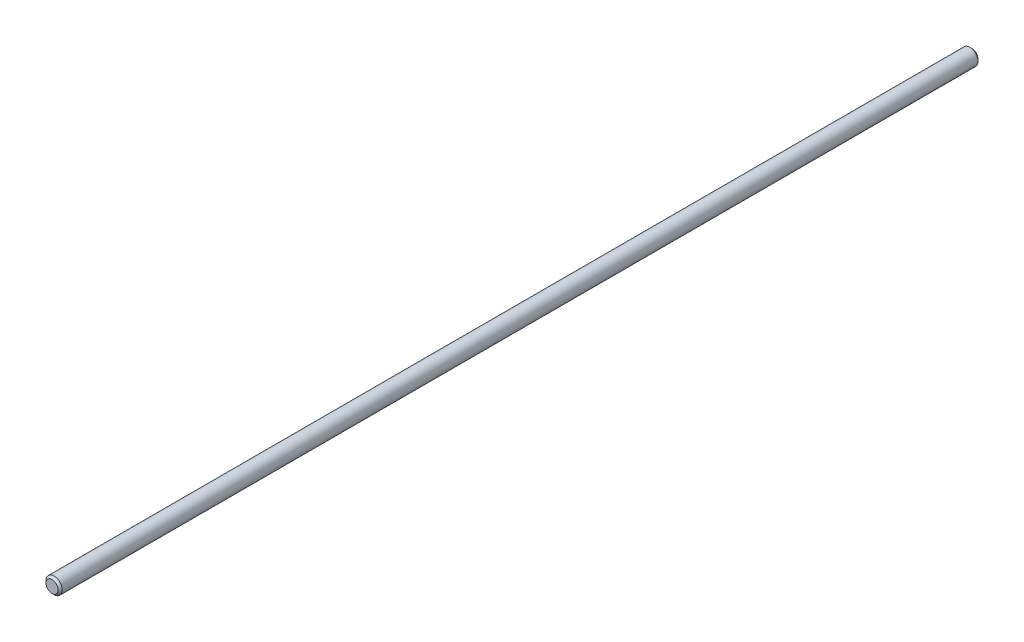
ISO-10303-21;
HEADER;
FILE_DESCRIPTION(('STEP AP214'),'2;1');
FILE_NAME('part.step','',(''),(''),'','','');
FILE_SCHEMA(('AUTOMOTIVE_DESIGN { 1 0 10303 214 1 1 1 1 }'));
ENDSEC;
DATA;
#1=APPLICATION_CONTEXT('core data for automotive mechanical design processes');
#2=APPLICATION_PROTOCOL_DEFINITION('international standard','automotive_design',2000,#1);
#3=PRODUCT_CONTEXT('',#1,'mechanical');
#4=PRODUCT('Part','Part','',(#3));
#5=PRODUCT_RELATED_PRODUCT_CATEGORY('part','',(#4));
#6=PRODUCT_DEFINITION_FORMATION('','',#4);
#7=PRODUCT_DEFINITION_CONTEXT('part definition',#1,'design');
#8=PRODUCT_DEFINITION('design','',#6,#7);
#9=PRODUCT_DEFINITION_SHAPE('','',#8);
#10=(LENGTH_UNIT() NAMED_UNIT(*) SI_UNIT(.MILLI.,.METRE.));
#11=(NAMED_UNIT(*) PLANE_ANGLE_UNIT() SI_UNIT($,.RADIAN.));
#12=(NAMED_UNIT(*) SI_UNIT($,.STERADIAN.) SOLID_ANGLE_UNIT());
#13=UNCERTAINTY_MEASURE_WITH_UNIT(LENGTH_MEASURE(1.E-05),#10,'distance_accuracy_value','');
#14=(GEOMETRIC_REPRESENTATION_CONTEXT(3) GLOBAL_UNCERTAINTY_ASSIGNED_CONTEXT((#13)) GLOBAL_UNIT_ASSIGNED_CONTEXT((#10,
#11,#12)) REPRESENTATION_CONTEXT('',''));
#15=CARTESIAN_POINT('',(0.,0.,0.));
#16=DIRECTION('',(0.,0.,1.));
#17=DIRECTION('',(1.,0.,0.));
#18=AXIS2_PLACEMENT_3D('',#15,#16,#17);
#19=CARTESIAN_POINT('',(0.,0.,-455.));
#20=DIRECTION('',(0.,0.,1.));
#21=DIRECTION('',(1.,0.,0.));
#22=AXIS2_PLACEMENT_3D('',#19,#20,#21);
#23=CYLINDRICAL_SURFACE('',#22,4.);
#24=CARTESIAN_POINT('',(0.,0.,-454.));
#25=DIRECTION('',(0.,0.,1.));
#26=DIRECTION('',(1.,0.,0.));
#27=AXIS2_PLACEMENT_3D('',#24,#25,#26);
#28=CIRCLE('',#27,4.);
#29=CARTESIAN_POINT('',(4.,0.,-454.));
#30=VERTEX_POINT('',#29);
#31=EDGE_CURVE('E352',#30,#30,#28,.T.);
#32=CARTESIAN_POINT('',(0.,0.,-1.00000000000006));
#33=DIRECTION('',(0.,0.,1.));
#34=DIRECTION('',(1.,0.,0.));
#35=AXIS2_PLACEMENT_3D('',#32,#33,#34);
#36=CIRCLE('',#35,4.);
#37=CARTESIAN_POINT('',(4.,0.,-1.00000000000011));
#38=VERTEX_POINT('',#37);
#39=EDGE_CURVE('E356',#38,#38,#36,.F.);
#40=CARTESIAN_POINT('',(4.,0.,-454.));
#41=CARTESIAN_POINT('',(4.,0.,-449.28125));
#42=CARTESIAN_POINT('',(4.,0.,-444.5625));
#43=CARTESIAN_POINT('',(4.,0.,-435.125));
#44=CARTESIAN_POINT('',(4.,0.,-430.40625));
#45=CARTESIAN_POINT('',(4.,0.,-420.96875));
#46=CARTESIAN_POINT('',(4.,0.,-416.25));
#47=CARTESIAN_POINT('',(4.,0.,-406.8125));
#48=CARTESIAN_POINT('',(4.,0.,-402.09375));
#49=CARTESIAN_POINT('',(4.,0.,-392.65625));
#50=CARTESIAN_POINT('',(4.,0.,-387.9375));
#51=CARTESIAN_POINT('',(4.,0.,-378.5));
#52=CARTESIAN_POINT('',(4.,0.,-373.78125));
#53=CARTESIAN_POINT('',(4.,0.,-364.34375));
#54=CARTESIAN_POINT('',(4.,0.,-359.625));
#55=CARTESIAN_POINT('',(4.,0.,-350.1875));
#56=CARTESIAN_POINT('',(4.,0.,-345.46875));
#57=CARTESIAN_POINT('',(4.,0.,-336.03125));
#58=CARTESIAN_POINT('',(4.,0.,-331.3125));
#59=CARTESIAN_POINT('',(4.,0.,-321.875));
#60=CARTESIAN_POINT('',(4.,0.,-317.15625));
#61=CARTESIAN_POINT('',(4.,0.,-307.71875));
#62=CARTESIAN_POINT('',(4.,0.,-303.));
#63=CARTESIAN_POINT('',(4.,0.,-293.5625));
#64=CARTESIAN_POINT('',(4.,0.,-288.84375));
#65=CARTESIAN_POINT('',(4.,0.,-279.40625));
#66=CARTESIAN_POINT('',(4.,0.,-274.6875));
#67=CARTESIAN_POINT('',(4.,0.,-265.25));
#68=CARTESIAN_POINT('',(4.,0.,-260.53125));
#69=CARTESIAN_POINT('',(4.,0.,-251.09375));
#70=CARTESIAN_POINT('',(4.,0.,-246.375));
#71=CARTESIAN_POINT('',(4.,0.,-236.9375));
#72=CARTESIAN_POINT('',(4.,0.,-232.21875));
#73=CARTESIAN_POINT('',(4.,0.,-222.78125));
#74=CARTESIAN_POINT('',(4.,0.,-218.0625));
#75=CARTESIAN_POINT('',(4.,0.,-208.625));
#76=CARTESIAN_POINT('',(4.,0.,-203.90625));
#77=CARTESIAN_POINT('',(4.,0.,-194.46875));
#78=CARTESIAN_POINT('',(4.,0.,-189.75));
#79=CARTESIAN_POINT('',(4.,0.,-180.3125));
#80=CARTESIAN_POINT('',(4.,0.,-175.59375));
#81=CARTESIAN_POINT('',(4.,0.,-166.15625));
#82=CARTESIAN_POINT('',(4.,0.,-161.4375));
#83=CARTESIAN_POINT('',(4.,0.,-152.));
#84=CARTESIAN_POINT('',(4.,0.,-147.28125));
#85=CARTESIAN_POINT('',(4.,0.,-137.84375));
#86=CARTESIAN_POINT('',(4.,0.,-133.125));
#87=CARTESIAN_POINT('',(4.,0.,-123.6875));
#88=CARTESIAN_POINT('',(4.,0.,-118.96875));
#89=CARTESIAN_POINT('',(4.,0.,-109.53125));
#90=CARTESIAN_POINT('',(4.,0.,-104.8125));
#91=CARTESIAN_POINT('',(4.,0.,-95.3750000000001));
#92=CARTESIAN_POINT('',(4.,0.,-90.6562500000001));
#93=CARTESIAN_POINT('',(4.,0.,-81.2187500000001));
#94=CARTESIAN_POINT('',(4.,0.,-76.5000000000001));
#95=CARTESIAN_POINT('',(4.,0.,-67.0625000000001));
#96=CARTESIAN_POINT('',(4.,0.,-62.3437500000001));
#97=CARTESIAN_POINT('',(4.,0.,-52.9062500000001));
#98=CARTESIAN_POINT('',(4.,0.,-48.1875000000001));
#99=CARTESIAN_POINT('',(4.,0.,-38.7500000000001));
#100=CARTESIAN_POINT('',(4.,0.,-34.0312500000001));
#101=CARTESIAN_POINT('',(4.,0.,-24.5937500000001));
#102=CARTESIAN_POINT('',(4.,0.,-19.8750000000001));
#103=CARTESIAN_POINT('',(4.,0.,-10.4375000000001));
#104=CARTESIAN_POINT('',(4.,0.,-5.7187500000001));
#105=CARTESIAN_POINT('',(4.,0.,-1.00000000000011));
#106=B_SPLINE_CURVE_WITH_KNOTS('',3,(#40,#41,#42,#43,#44,#45,#46,#47,#48,#49,#50,#51,#52,#53,
#54,#55,#56,#57,#58,#59,#60,#61,#62,#63,#64,#65,#66,#67,#68,#69,#70,#71,#72,#73,#74,#75,#76,#77,
#78,#79,#80,#81,#82,#83,#84,#85,#86,#87,#88,#89,#90,#91,#92,#93,#94,#95,#96,#97,#98,#99,#100,
#101,#102,#103,#104,#105),.UNSPECIFIED.,.F.,.F.,(4,2,2,2,2,2,2,2,2,2,2,2,2,2,2,2,2,2,2,2,2,2,2,
2,2,2,2,2,2,2,2,2,4),(0.,14.15625,28.3125,42.4687499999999,56.625,70.78125,84.9374999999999,
99.0937499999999,113.25,127.40625,141.5625,155.71875,169.875,184.03125,198.1875,212.34375,226.5,
240.65625,254.8125,268.96875,283.125,297.28125,311.4375,325.59375,339.75,353.90625,368.0625,
382.21875,396.375,410.53125,424.6875,438.84375,453.),.UNSPECIFIED.);
#107=EDGE_CURVE('BSEAM346',#30,#38,#106,.T.);
#108=ORIENTED_EDGE('',*,*,#31,.T.);
#109=ORIENTED_EDGE('',*,*,#39,.T.);
#110=ORIENTED_EDGE('',*,*,#107,.T.);
#111=ORIENTED_EDGE('',*,*,#107,.F.);
#112=EDGE_LOOP('',(#108,#110,#109,#111));
#113=FACE_BOUND('',#112,.T.);
#114=ADVANCED_FACE('F346',(#113),#23,.T.);
#115=CARTESIAN_POINT('',(0.,0.,-455.));
#116=DIRECTION('',(0.,0.,1.));
#117=DIRECTION('',(1.,0.,0.));
#118=AXIS2_PLACEMENT_3D('',#115,#116,#117);
#119=PLANE('',#118);
#120=CARTESIAN_POINT('',(0.,0.,-455.));
#121=DIRECTION('',(0.,0.,1.));
#122=DIRECTION('',(1.,0.,0.));
#123=AXIS2_PLACEMENT_3D('',#120,#121,#122);
#124=CIRCLE('',#123,3.);
#125=CARTESIAN_POINT('',(3.,0.,-455.));
#126=VERTEX_POINT('',#125);
#127=EDGE_CURVE('E10',#126,#126,#124,.F.);
#128=ORIENTED_EDGE('',*,*,#127,.T.);
#129=EDGE_LOOP('',(#128));
#130=FACE_BOUND('',#129,.T.);
#131=ADVANCED_FACE('F380',(#130),#119,.F.);
#132=CARTESIAN_POINT('',(0.,0.,0.));
#133=DIRECTION('',(0.,0.,1.));
#134=DIRECTION('',(1.,0.,0.));
#135=AXIS2_PLACEMENT_3D('',#132,#133,#134);
#136=PLANE('',#135);
#137=CARTESIAN_POINT('',(0.,0.,0.));
#138=DIRECTION('',(0.,0.,1.));
#139=DIRECTION('',(1.,0.,0.));
#140=AXIS2_PLACEMENT_3D('',#137,#138,#139);
#141=CIRCLE('',#140,2.99999999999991);
#142=CARTESIAN_POINT('',(2.99999999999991,0.,0.));
#143=VERTEX_POINT('',#142);
#144=EDGE_CURVE('E360',#143,#143,#141,.T.);
#145=ORIENTED_EDGE('',*,*,#144,.T.);
#146=EDGE_LOOP('',(#145));
#147=FACE_BOUND('',#146,.T.);
#148=ADVANCED_FACE('F366',(#147),#136,.T.);
#149=CARTESIAN_POINT('',(0.,0.,0.));
#150=DIRECTION('',(0.,0.,-1.));
#151=DIRECTION('',(-1.,0.,0.));
#152=AXIS2_PLACEMENT_3D('',#149,#150,#151);
#153=CONICAL_SURFACE('',#152,2.99999999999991,0.785398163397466);
#154=ORIENTED_EDGE('',*,*,#39,.F.);
#155=EDGE_LOOP('',(#154));
#156=FACE_BOUND('',#155,.T.);
#157=ORIENTED_EDGE('',*,*,#144,.F.);
#158=EDGE_LOOP('',(#157));
#159=FACE_BOUND('',#158,.T.);
#160=ADVANCED_FACE('F368',(#156,#159),#153,.T.);
#161=CARTESIAN_POINT('',(0.,0.,-454.));
#162=DIRECTION('',(0.,0.,1.));
#163=DIRECTION('',(1.,0.,0.));
#164=AXIS2_PLACEMENT_3D('',#161,#162,#163);
#165=CONICAL_SURFACE('',#164,4.,0.785398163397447);
#166=ORIENTED_EDGE('',*,*,#127,.F.);
#167=EDGE_LOOP('',(#166));
#168=FACE_BOUND('',#167,.T.);
#169=ORIENTED_EDGE('',*,*,#31,.F.);
#170=EDGE_LOOP('',(#169));
#171=FACE_BOUND('',#170,.T.);
#172=ADVANCED_FACE('F370',(#168,#171),#165,.T.);
#173=CLOSED_SHELL('',(#114,#131,#148,#160,#172));
#174=MANIFOLD_SOLID_BREP('B2',#173);
#175=ADVANCED_BREP_SHAPE_REPRESENTATION('',(#18,#174),#14);
#176=SHAPE_DEFINITION_REPRESENTATION(#9,#175);
ENDSEC;
END-ISO-10303-21;
